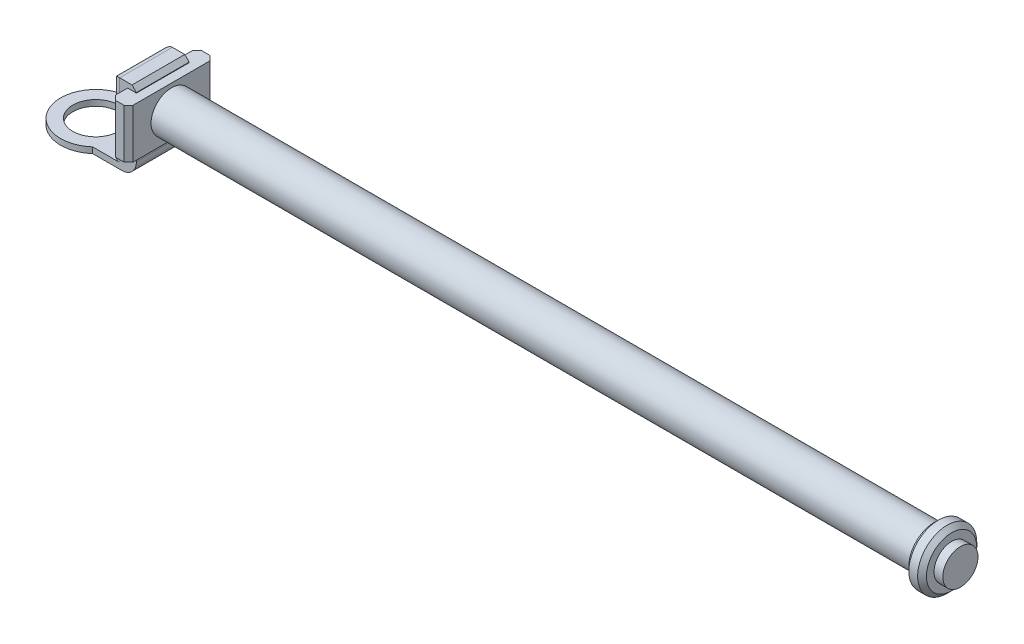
ISO-10303-21;
HEADER;
FILE_DESCRIPTION(('STEP AP214'),'2;1');
FILE_NAME('part.step','',(''),(''),'','','');
FILE_SCHEMA(('AUTOMOTIVE_DESIGN { 1 0 10303 214 1 1 1 1 }'));
ENDSEC;
DATA;
#1=APPLICATION_CONTEXT('core data for automotive mechanical design processes');
#2=APPLICATION_PROTOCOL_DEFINITION('international standard','automotive_design',2000,#1);
#3=PRODUCT_CONTEXT('',#1,'mechanical');
#4=PRODUCT('Part','Part','',(#3));
#5=PRODUCT_RELATED_PRODUCT_CATEGORY('part','',(#4));
#6=PRODUCT_DEFINITION_FORMATION('','',#4);
#7=PRODUCT_DEFINITION_CONTEXT('part definition',#1,'design');
#8=PRODUCT_DEFINITION('design','',#6,#7);
#9=PRODUCT_DEFINITION_SHAPE('','',#8);
#10=(LENGTH_UNIT() NAMED_UNIT(*) SI_UNIT(.MILLI.,.METRE.));
#11=(NAMED_UNIT(*) PLANE_ANGLE_UNIT() SI_UNIT($,.RADIAN.));
#12=(NAMED_UNIT(*) SI_UNIT($,.STERADIAN.) SOLID_ANGLE_UNIT());
#13=UNCERTAINTY_MEASURE_WITH_UNIT(LENGTH_MEASURE(1.E-05),#10,'distance_accuracy_value','');
#14=(GEOMETRIC_REPRESENTATION_CONTEXT(3) GLOBAL_UNCERTAINTY_ASSIGNED_CONTEXT((#13)) GLOBAL_UNIT_ASSIGNED_CONTEXT((#10,
#11,#12)) REPRESENTATION_CONTEXT('',''));
#15=CARTESIAN_POINT('',(0.,0.,0.));
#16=DIRECTION('',(0.,0.,1.));
#17=DIRECTION('',(1.,0.,0.));
#18=AXIS2_PLACEMENT_3D('',#15,#16,#17);
#19=CARTESIAN_POINT('',(0.,2.,-9.));
#20=DIRECTION('',(0.,0.,1.));
#21=DIRECTION('',(1.,0.,0.));
#22=AXIS2_PLACEMENT_3D('',#19,#20,#21);
#23=PLANE('',#22);
#24=DIRECTION('',(-1.,0.,0.));
#25=VECTOR('',#24,1.);
#26=CARTESIAN_POINT('',(0.,27.,-9.));
#27=LINE('',#26,#25);
#28=CARTESIAN_POINT('',(21.3554838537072,27.,-9.));
#29=VERTEX_POINT('',#28);
#30=CARTESIAN_POINT('',(17.1473964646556,27.,-9.));
#31=VERTEX_POINT('',#30);
#32=EDGE_CURVE('E196',#29,#31,#27,.T.);
#33=ORIENTED_EDGE('',*,*,#32,.F.);
#34=DIRECTION('',(0.707106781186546,-0.707106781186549,0.));
#35=VECTOR('',#34,1.);
#36=CARTESIAN_POINT('',(21.3554838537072,27.,-9.));
#37=LINE('',#36,#35);
#38=CARTESIAN_POINT('',(22.8554838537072,25.5,-9.));
#39=VERTEX_POINT('',#38);
#40=EDGE_CURVE('E231',#29,#39,#37,.T.);
#41=ORIENTED_EDGE('',*,*,#40,.T.);
#42=DIRECTION('',(0.,-1.,0.));
#43=VECTOR('',#42,1.);
#44=CARTESIAN_POINT('',(22.8554838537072,27.,-9.));
#45=LINE('',#44,#43);
#46=CARTESIAN_POINT('',(22.8554838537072,25.3259975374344,-9.));
#47=VERTEX_POINT('',#46);
#48=EDGE_CURVE('E195',#39,#47,#45,.T.);
#49=ORIENTED_EDGE('',*,*,#48,.T.);
#50=DIRECTION('',(1.,0.,0.));
#51=VECTOR('',#50,1.);
#52=CARTESIAN_POINT('',(0.,25.3259975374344,-9.));
#53=LINE('',#52,#51);
#54=CARTESIAN_POINT('',(19.8554838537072,25.3259975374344,-9.));
#55=VERTEX_POINT('',#54);
#56=EDGE_CURVE('E343',#55,#47,#53,.T.);
#57=ORIENTED_EDGE('',*,*,#56,.F.);
#58=DIRECTION('',(0.,-1.,0.));
#59=VECTOR('',#58,1.);
#60=CARTESIAN_POINT('',(19.8554838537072,2.,-9.));
#61=LINE('',#60,#59);
#62=CARTESIAN_POINT('',(19.8554838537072,8.51166149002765,-9.));
#63=VERTEX_POINT('',#62);
#64=EDGE_CURVE('E203',#55,#63,#61,.T.);
#65=ORIENTED_EDGE('',*,*,#64,.T.);
#66=DIRECTION('',(-1.,0.,0.));
#67=VECTOR('',#66,1.);
#68=CARTESIAN_POINT('',(0.,8.51166149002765,-9.));
#69=LINE('',#68,#67);
#70=CARTESIAN_POINT('',(22.8554838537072,8.51166149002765,-9.));
#71=VERTEX_POINT('',#70);
#72=EDGE_CURVE('E199',#71,#63,#69,.T.);
#73=ORIENTED_EDGE('',*,*,#72,.F.);
#74=CARTESIAN_POINT('',(22.8554838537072,5.,-9.));
#75=VERTEX_POINT('',#74);
#76=EDGE_CURVE('E185',#71,#75,#45,.T.);
#77=ORIENTED_EDGE('',*,*,#76,.T.);
#78=CARTESIAN_POINT('',(17.8554838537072,5.,-9.));
#79=DIRECTION('',(0.,0.,1.));
#80=DIRECTION('',(1.,0.,0.));
#81=AXIS2_PLACEMENT_3D('',#78,#79,#80);
#82=CIRCLE('',#81,5.);
#83=CARTESIAN_POINT('',(17.8554838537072,0.,-9.));
#84=VERTEX_POINT('',#83);
#85=EDGE_CURVE('E391',#75,#84,#82,.F.);
#86=ORIENTED_EDGE('',*,*,#85,.T.);
#87=DIRECTION('',(-1.,0.,0.));
#88=VECTOR('',#87,1.);
#89=CARTESIAN_POINT('',(0.,0.,-9.));
#90=LINE('',#89,#88);
#91=CARTESIAN_POINT('',(7.93725393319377,0.,-9.));
#92=VERTEX_POINT('',#91);
#93=EDGE_CURVE('E358',#84,#92,#90,.T.);
#94=ORIENTED_EDGE('',*,*,#93,.T.);
#95=DIRECTION('',(0.,-1.,0.));
#96=VECTOR('',#95,1.);
#97=CARTESIAN_POINT('',(7.93725393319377,2.,-9.));
#98=LINE('',#97,#96);
#99=CARTESIAN_POINT('',(7.93725393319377,2.,-9.));
#100=VERTEX_POINT('',#99);
#101=EDGE_CURVE('E368',#100,#92,#98,.T.);
#102=ORIENTED_EDGE('',*,*,#101,.F.);
#103=DIRECTION('',(-1.,0.,0.));
#104=VECTOR('',#103,1.);
#105=CARTESIAN_POINT('',(0.,2.,-9.));
#106=LINE('',#105,#104);
#107=CARTESIAN_POINT('',(17.1473964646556,2.,-9.));
#108=VERTEX_POINT('',#107);
#109=EDGE_CURVE('E359',#108,#100,#106,.T.);
#110=ORIENTED_EDGE('',*,*,#109,.F.);
#111=DIRECTION('',(0.,-1.,0.));
#112=VECTOR('',#111,1.);
#113=CARTESIAN_POINT('',(17.1473964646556,2.,-9.));
#114=LINE('',#113,#112);
#115=EDGE_CURVE('E405',#108,#31,#114,.F.);
#116=ORIENTED_EDGE('',*,*,#115,.T.);
#117=EDGE_LOOP('',(#33,#41,#49,#57,#65,#73,#77,#86,#94,#102,#110,#116));
#118=FACE_BOUND('',#117,.T.);
#119=ADVANCED_FACE('F35',(#118),#23,.F.);
#120=CARTESIAN_POINT('',(0.,2.,9.));
#121=DIRECTION('',(0.,0.,-1.));
#122=DIRECTION('',(-1.,0.,0.));
#123=AXIS2_PLACEMENT_3D('',#120,#121,#122);
#124=PLANE('',#123);
#125=DIRECTION('',(0.,-1.,0.));
#126=VECTOR('',#125,1.);
#127=CARTESIAN_POINT('',(22.8554838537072,27.,9.));
#128=LINE('',#127,#126);
#129=CARTESIAN_POINT('',(22.8554838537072,25.5,9.));
#130=VERTEX_POINT('',#129);
#131=CARTESIAN_POINT('',(22.8554838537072,25.3259975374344,9.));
#132=VERTEX_POINT('',#131);
#133=EDGE_CURVE('E356',#130,#132,#128,.T.);
#134=ORIENTED_EDGE('',*,*,#133,.F.);
#135=DIRECTION('',(-0.707106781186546,0.707106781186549,0.));
#136=VECTOR('',#135,1.);
#137=CARTESIAN_POINT('',(21.3554838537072,27.,9.));
#138=LINE('',#137,#136);
#139=CARTESIAN_POINT('',(21.3554838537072,27.,9.));
#140=VERTEX_POINT('',#139);
#141=EDGE_CURVE('E235',#130,#140,#138,.T.);
#142=ORIENTED_EDGE('',*,*,#141,.T.);
#143=DIRECTION('',(1.,0.,0.));
#144=VECTOR('',#143,1.);
#145=CARTESIAN_POINT('',(0.,27.,9.));
#146=LINE('',#145,#144);
#147=CARTESIAN_POINT('',(17.1473964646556,27.,9.));
#148=VERTEX_POINT('',#147);
#149=EDGE_CURVE('E348',#148,#140,#146,.T.);
#150=ORIENTED_EDGE('',*,*,#149,.F.);
#151=DIRECTION('',(0.,-1.,0.));
#152=VECTOR('',#151,1.);
#153=CARTESIAN_POINT('',(17.1473964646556,2.,9.));
#154=LINE('',#153,#152);
#155=CARTESIAN_POINT('',(17.1473964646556,2.,9.));
#156=VERTEX_POINT('',#155);
#157=EDGE_CURVE('E402',#148,#156,#154,.T.);
#158=ORIENTED_EDGE('',*,*,#157,.T.);
#159=DIRECTION('',(1.,0.,0.));
#160=VECTOR('',#159,1.);
#161=CARTESIAN_POINT('',(0.,2.,9.));
#162=LINE('',#161,#160);
#163=CARTESIAN_POINT('',(7.93725393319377,2.,9.));
#164=VERTEX_POINT('',#163);
#165=EDGE_CURVE('E361',#164,#156,#162,.T.);
#166=ORIENTED_EDGE('',*,*,#165,.F.);
#167=DIRECTION('',(0.,-1.,0.));
#168=VECTOR('',#167,1.);
#169=CARTESIAN_POINT('',(7.93725393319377,2.,9.));
#170=LINE('',#169,#168);
#171=CARTESIAN_POINT('',(7.93725393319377,0.,9.));
#172=VERTEX_POINT('',#171);
#173=EDGE_CURVE('E364',#164,#172,#170,.T.);
#174=ORIENTED_EDGE('',*,*,#173,.T.);
#175=DIRECTION('',(1.,0.,0.));
#176=VECTOR('',#175,1.);
#177=CARTESIAN_POINT('',(0.,0.,9.));
#178=LINE('',#177,#176);
#179=CARTESIAN_POINT('',(17.8554838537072,0.,9.));
#180=VERTEX_POINT('',#179);
#181=EDGE_CURVE('E362',#172,#180,#178,.T.);
#182=ORIENTED_EDGE('',*,*,#181,.T.);
#183=CARTESIAN_POINT('',(17.8554838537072,5.,9.));
#184=DIRECTION('',(0.,0.,-1.));
#185=DIRECTION('',(-1.,0.,0.));
#186=AXIS2_PLACEMENT_3D('',#183,#184,#185);
#187=CIRCLE('',#186,5.);
#188=CARTESIAN_POINT('',(22.8554838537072,5.,9.));
#189=VERTEX_POINT('',#188);
#190=EDGE_CURVE('E387',#180,#189,#187,.F.);
#191=ORIENTED_EDGE('',*,*,#190,.T.);
#192=CARTESIAN_POINT('',(22.8554838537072,8.51166149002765,9.));
#193=VERTEX_POINT('',#192);
#194=EDGE_CURVE('E355',#193,#189,#128,.T.);
#195=ORIENTED_EDGE('',*,*,#194,.F.);
#196=DIRECTION('',(1.,0.,0.));
#197=VECTOR('',#196,1.);
#198=CARTESIAN_POINT('',(0.,8.51166149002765,9.));
#199=LINE('',#198,#197);
#200=CARTESIAN_POINT('',(19.8554838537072,8.51166149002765,9.));
#201=VERTEX_POINT('',#200);
#202=EDGE_CURVE('E208',#201,#193,#199,.T.);
#203=ORIENTED_EDGE('',*,*,#202,.F.);
#204=DIRECTION('',(0.,1.,0.));
#205=VECTOR('',#204,1.);
#206=CARTESIAN_POINT('',(19.8554838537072,2.,9.));
#207=LINE('',#206,#205);
#208=CARTESIAN_POINT('',(19.8554838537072,25.3259975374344,9.));
#209=VERTEX_POINT('',#208);
#210=EDGE_CURVE('E218',#201,#209,#207,.T.);
#211=ORIENTED_EDGE('',*,*,#210,.T.);
#212=DIRECTION('',(-1.,0.,0.));
#213=VECTOR('',#212,1.);
#214=CARTESIAN_POINT('',(0.,25.3259975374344,9.));
#215=LINE('',#214,#213);
#216=EDGE_CURVE('E207',#132,#209,#215,.T.);
#217=ORIENTED_EDGE('',*,*,#216,.F.);
#218=EDGE_LOOP('',(#134,#142,#150,#158,#166,#174,#182,#191,#195,#203,#211,#217));
#219=FACE_BOUND('',#218,.T.);
#220=ADVANCED_FACE('F438',(#219),#124,.F.);
#221=CARTESIAN_POINT('',(22.8554838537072,27.,0.));
#222=DIRECTION('',(-1.,0.,0.));
#223=DIRECTION('',(0.,0.,1.));
#224=AXIS2_PLACEMENT_3D('',#221,#222,#223);
#225=PLANE('',#224);
#226=ORIENTED_EDGE('',*,*,#48,.F.);
#227=DIRECTION('',(0.,0.,1.));
#228=VECTOR('',#227,1.);
#229=CARTESIAN_POINT('',(22.8554838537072,25.5,9.));
#230=LINE('',#229,#228);
#231=EDGE_CURVE('E233',#39,#130,#230,.T.);
#232=ORIENTED_EDGE('',*,*,#231,.T.);
#233=ORIENTED_EDGE('',*,*,#133,.T.);
#234=DIRECTION('',(0.,0.,1.));
#235=VECTOR('',#234,1.);
#236=CARTESIAN_POINT('',(22.8554838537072,25.3259975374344,0.));
#237=LINE('',#236,#235);
#238=EDGE_CURVE('E214',#47,#132,#237,.T.);
#239=ORIENTED_EDGE('',*,*,#238,.F.);
#240=EDGE_LOOP('',(#226,#232,#233,#239));
#241=FACE_BOUND('',#240,.T.);
#242=ADVANCED_FACE('F509',(#241),#225,.F.);
#243=DIRECTION('',(0.,0.,-1.));
#244=VECTOR('',#243,1.);
#245=CARTESIAN_POINT('',(22.8554838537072,8.51166149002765,0.));
#246=LINE('',#245,#244);
#247=EDGE_CURVE('E189',#193,#71,#246,.T.);
#248=ORIENTED_EDGE('',*,*,#247,.F.);
#249=ORIENTED_EDGE('',*,*,#194,.T.);
#250=DIRECTION('',(0.,0.,1.));
#251=VECTOR('',#250,1.);
#252=CARTESIAN_POINT('',(22.8554838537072,5.,0.));
#253=LINE('',#252,#251);
#254=EDGE_CURVE('E192',#189,#75,#253,.F.);
#255=ORIENTED_EDGE('',*,*,#254,.T.);
#256=ORIENTED_EDGE('',*,*,#76,.F.);
#257=EDGE_LOOP('',(#248,#249,#255,#256));
#258=FACE_BOUND('',#257,.T.);
#259=ADVANCED_FACE('F187',(#258),#225,.F.);
#260=CARTESIAN_POINT('',(0.,2.,0.));
#261=DIRECTION('',(0.,1.,0.));
#262=DIRECTION('',(0.,0.,1.));
#263=AXIS2_PLACEMENT_3D('',#260,#261,#262);
#264=PLANE('',#263);
#265=DIRECTION('',(0.,0.,1.));
#266=VECTOR('',#265,1.);
#267=CARTESIAN_POINT('',(14.6473964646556,2.,0.));
#268=LINE('',#267,#266);
#269=CARTESIAN_POINT('',(14.6473964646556,2.,-6.5));
#270=VERTEX_POINT('',#269);
#271=CARTESIAN_POINT('',(14.6473964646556,2.,6.5));
#272=VERTEX_POINT('',#271);
#273=EDGE_CURVE('E351',#270,#272,#268,.T.);
#274=ORIENTED_EDGE('',*,*,#273,.F.);
#275=CARTESIAN_POINT('',(17.1473964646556,1.99999999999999,-6.5));
#276=DIRECTION('',(0.,1.,0.));
#277=DIRECTION('',(0.,0.,1.));
#278=AXIS2_PLACEMENT_3D('',#275,#276,#277);
#279=CIRCLE('',#278,2.5);
#280=EDGE_CURVE('E215',#270,#108,#279,.F.);
#281=ORIENTED_EDGE('',*,*,#280,.T.);
#282=ORIENTED_EDGE('',*,*,#109,.T.);
#283=CARTESIAN_POINT('',(0.,2.,0.));
#284=DIRECTION('',(0.,1.,0.));
#285=DIRECTION('',(0.,0.,1.));
#286=AXIS2_PLACEMENT_3D('',#283,#284,#285);
#287=CIRCLE('',#286,12.);
#288=EDGE_CURVE('E377',#100,#164,#287,.T.);
#289=ORIENTED_EDGE('',*,*,#288,.T.);
#290=ORIENTED_EDGE('',*,*,#165,.T.);
#291=CARTESIAN_POINT('',(17.1473964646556,2.,6.5));
#292=DIRECTION('',(0.,1.,0.));
#293=DIRECTION('',(0.,0.,1.));
#294=AXIS2_PLACEMENT_3D('',#291,#292,#293);
#295=CIRCLE('',#294,2.5);
#296=EDGE_CURVE('E221',#156,#272,#295,.F.);
#297=ORIENTED_EDGE('',*,*,#296,.T.);
#298=EDGE_LOOP('',(#274,#281,#282,#289,#290,#297));
#299=FACE_BOUND('',#298,.T.);
#300=CARTESIAN_POINT('',(0.,2.,0.));
#301=DIRECTION('',(0.,1.,0.));
#302=DIRECTION('',(0.,0.,1.));
#303=AXIS2_PLACEMENT_3D('',#300,#301,#302);
#304=CIRCLE('',#303,7.8);
#305=CARTESIAN_POINT('',(0.,2.,7.8));
#306=VERTEX_POINT('',#305);
#307=EDGE_CURVE('E374',#306,#306,#304,.T.);
#308=ORIENTED_EDGE('',*,*,#307,.F.);
#309=EDGE_LOOP('',(#308));
#310=FACE_BOUND('',#309,.T.);
#311=ADVANCED_FACE('F426',(#299,#310),#264,.T.);
#312=CARTESIAN_POINT('',(0.,2.,0.));
#313=DIRECTION('',(0.,-1.,0.));
#314=DIRECTION('',(0.,0.,-1.));
#315=AXIS2_PLACEMENT_3D('',#312,#313,#314);
#316=CYLINDRICAL_SURFACE('',#315,12.);
#317=ORIENTED_EDGE('',*,*,#101,.T.);
#318=CARTESIAN_POINT('',(0.,0.,0.));
#319=DIRECTION('',(0.,1.,0.));
#320=DIRECTION('',(0.,0.,1.));
#321=AXIS2_PLACEMENT_3D('',#318,#319,#320);
#322=CIRCLE('',#321,12.);
#323=EDGE_CURVE('E378',#92,#172,#322,.T.);
#324=ORIENTED_EDGE('',*,*,#323,.T.);
#325=ORIENTED_EDGE('',*,*,#173,.F.);
#326=ORIENTED_EDGE('',*,*,#288,.F.);
#327=EDGE_LOOP('',(#317,#324,#325,#326));
#328=FACE_BOUND('',#327,.T.);
#329=ADVANCED_FACE('F448',(#328),#316,.T.);
#330=CARTESIAN_POINT('',(0.,2.,0.));
#331=DIRECTION('',(0.,-1.,0.));
#332=DIRECTION('',(0.,0.,-1.));
#333=AXIS2_PLACEMENT_3D('',#330,#331,#332);
#334=CYLINDRICAL_SURFACE('',#333,7.8);
#335=ORIENTED_EDGE('',*,*,#307,.T.);
#336=EDGE_LOOP('',(#335));
#337=FACE_BOUND('',#336,.T.);
#338=CARTESIAN_POINT('',(0.,0.,0.));
#339=DIRECTION('',(0.,1.,0.));
#340=DIRECTION('',(0.,0.,1.));
#341=AXIS2_PLACEMENT_3D('',#338,#339,#340);
#342=CIRCLE('',#341,7.8);
#343=CARTESIAN_POINT('',(0.,0.,7.8));
#344=VERTEX_POINT('',#343);
#345=EDGE_CURVE('E371',#344,#344,#342,.T.);
#346=ORIENTED_EDGE('',*,*,#345,.F.);
#347=EDGE_LOOP('',(#346));
#348=FACE_BOUND('',#347,.T.);
#349=ADVANCED_FACE('F517',(#337,#348),#334,.F.);
#350=CARTESIAN_POINT('',(0.,0.,0.));
#351=DIRECTION('',(0.,1.,0.));
#352=DIRECTION('',(0.,0.,1.));
#353=AXIS2_PLACEMENT_3D('',#350,#351,#352);
#354=PLANE('',#353);
#355=ORIENTED_EDGE('',*,*,#345,.T.);
#356=EDGE_LOOP('',(#355));
#357=FACE_BOUND('',#356,.T.);
#358=ORIENTED_EDGE('',*,*,#93,.F.);
#359=DIRECTION('',(0.,0.,1.));
#360=VECTOR('',#359,1.);
#361=CARTESIAN_POINT('',(17.8554838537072,0.,0.));
#362=LINE('',#361,#360);
#363=EDGE_CURVE('E381',#84,#180,#362,.T.);
#364=ORIENTED_EDGE('',*,*,#363,.T.);
#365=ORIENTED_EDGE('',*,*,#181,.F.);
#366=ORIENTED_EDGE('',*,*,#323,.F.);
#367=EDGE_LOOP('',(#358,#364,#365,#366));
#368=FACE_BOUND('',#367,.T.);
#369=ADVANCED_FACE('F453',(#357,#368),#354,.F.);
#370=CARTESIAN_POINT('',(14.6473964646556,27.,0.));
#371=DIRECTION('',(1.,0.,0.));
#372=DIRECTION('',(0.,0.,-1.));
#373=AXIS2_PLACEMENT_3D('',#370,#371,#372);
#374=PLANE('',#373);
#375=ORIENTED_EDGE('',*,*,#273,.T.);
#376=DIRECTION('',(0.,-1.,0.));
#377=VECTOR('',#376,1.);
#378=CARTESIAN_POINT('',(14.6473964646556,27.,6.5));
#379=LINE('',#378,#377);
#380=CARTESIAN_POINT('',(14.6473964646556,24.5,6.5));
#381=VERTEX_POINT('',#380);
#382=EDGE_CURVE('E400',#272,#381,#379,.F.);
#383=ORIENTED_EDGE('',*,*,#382,.T.);
#384=DIRECTION('',(0.,0.,1.));
#385=VECTOR('',#384,1.);
#386=CARTESIAN_POINT('',(14.6473964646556,24.5,-9.));
#387=LINE('',#386,#385);
#388=CARTESIAN_POINT('',(14.6473964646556,24.5,-6.5));
#389=VERTEX_POINT('',#388);
#390=EDGE_CURVE('E398',#381,#389,#387,.F.);
#391=ORIENTED_EDGE('',*,*,#390,.T.);
#392=DIRECTION('',(0.,-1.,0.));
#393=VECTOR('',#392,1.);
#394=CARTESIAN_POINT('',(14.6473964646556,27.,-6.5));
#395=LINE('',#394,#393);
#396=EDGE_CURVE('E396',#389,#270,#395,.T.);
#397=ORIENTED_EDGE('',*,*,#396,.T.);
#398=EDGE_LOOP('',(#375,#383,#391,#397));
#399=FACE_BOUND('',#398,.T.);
#400=ADVANCED_FACE('F423',(#399),#374,.F.);
#401=CARTESIAN_POINT('',(0.,27.,0.));
#402=DIRECTION('',(0.,1.,0.));
#403=DIRECTION('',(0.,0.,1.));
#404=AXIS2_PLACEMENT_3D('',#401,#402,#403);
#405=PLANE('',#404);
#406=ORIENTED_EDGE('',*,*,#149,.T.);
#407=DIRECTION('',(0.,0.,-1.));
#408=VECTOR('',#407,1.);
#409=CARTESIAN_POINT('',(21.3554838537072,27.,-9.));
#410=LINE('',#409,#408);
#411=EDGE_CURVE('E228',#140,#29,#410,.T.);
#412=ORIENTED_EDGE('',*,*,#411,.T.);
#413=ORIENTED_EDGE('',*,*,#32,.T.);
#414=DIRECTION('',(0.,0.,1.));
#415=VECTOR('',#414,1.);
#416=CARTESIAN_POINT('',(17.1473964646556,27.,9.));
#417=LINE('',#416,#415);
#418=EDGE_CURVE('E393',#31,#148,#417,.T.);
#419=ORIENTED_EDGE('',*,*,#418,.T.);
#420=EDGE_LOOP('',(#406,#412,#413,#419));
#421=FACE_BOUND('',#420,.T.);
#422=ADVANCED_FACE('F435',(#421),#405,.T.);
#423=CARTESIAN_POINT('',(17.8554838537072,5.,0.));
#424=DIRECTION('',(0.,0.,1.));
#425=DIRECTION('',(1.,0.,0.));
#426=AXIS2_PLACEMENT_3D('',#423,#424,#425);
#427=CYLINDRICAL_SURFACE('',#426,5.);
#428=ORIENTED_EDGE('',*,*,#85,.F.);
#429=ORIENTED_EDGE('',*,*,#254,.F.);
#430=ORIENTED_EDGE('',*,*,#190,.F.);
#431=ORIENTED_EDGE('',*,*,#363,.F.);
#432=EDGE_LOOP('',(#428,#429,#430,#431));
#433=FACE_BOUND('',#432,.T.);
#434=ADVANCED_FACE('F456',(#433),#427,.T.);
#435=CARTESIAN_POINT('',(17.1473964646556,27.,-6.5));
#436=DIRECTION('',(0.,-1.,0.));
#437=DIRECTION('',(0.,0.,-1.));
#438=AXIS2_PLACEMENT_3D('',#435,#436,#437);
#439=CYLINDRICAL_SURFACE('',#438,2.5);
#440=ORIENTED_EDGE('',*,*,#280,.F.);
#441=ORIENTED_EDGE('',*,*,#396,.F.);
#442=CARTESIAN_POINT('',(17.1473964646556,24.5,-6.5));
#443=DIRECTION('',(0.,-0.707106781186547,-0.707106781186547));
#444=DIRECTION('',(0.,-0.707106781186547,0.707106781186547));
#445=AXIS2_PLACEMENT_3D('',#442,#443,#444);
#446=ELLIPSE('',#445,3.53553390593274,2.5);
#447=EDGE_CURVE('E224',#31,#389,#446,.F.);
#448=ORIENTED_EDGE('',*,*,#447,.F.);
#449=ORIENTED_EDGE('',*,*,#115,.F.);
#450=EDGE_LOOP('',(#440,#441,#448,#449));
#451=FACE_BOUND('',#450,.T.);
#452=ADVANCED_FACE('F420',(#451),#439,.T.);
#453=CARTESIAN_POINT('',(17.1473964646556,2.,6.5));
#454=DIRECTION('',(0.,-1.,0.));
#455=DIRECTION('',(0.,0.,-1.));
#456=AXIS2_PLACEMENT_3D('',#453,#454,#455);
#457=CYLINDRICAL_SURFACE('',#456,2.5);
#458=ORIENTED_EDGE('',*,*,#296,.F.);
#459=ORIENTED_EDGE('',*,*,#157,.F.);
#460=CARTESIAN_POINT('',(17.1473964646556,24.5,6.5));
#461=DIRECTION('',(0.,-0.707106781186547,0.707106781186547));
#462=DIRECTION('',(0.,-0.707106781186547,-0.707106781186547));
#463=AXIS2_PLACEMENT_3D('',#460,#461,#462);
#464=ELLIPSE('',#463,3.53553390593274,2.5);
#465=EDGE_CURVE('E347',#381,#148,#464,.F.);
#466=ORIENTED_EDGE('',*,*,#465,.F.);
#467=ORIENTED_EDGE('',*,*,#382,.F.);
#468=EDGE_LOOP('',(#458,#459,#466,#467));
#469=FACE_BOUND('',#468,.T.);
#470=ADVANCED_FACE('F431',(#469),#457,.T.);
#471=CARTESIAN_POINT('',(17.1473964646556,24.5,0.));
#472=DIRECTION('',(0.,0.,-1.));
#473=DIRECTION('',(-1.,0.,0.));
#474=AXIS2_PLACEMENT_3D('',#471,#472,#473);
#475=CYLINDRICAL_SURFACE('',#474,2.5);
#476=ORIENTED_EDGE('',*,*,#447,.T.);
#477=ORIENTED_EDGE('',*,*,#390,.F.);
#478=ORIENTED_EDGE('',*,*,#465,.T.);
#479=ORIENTED_EDGE('',*,*,#418,.F.);
#480=EDGE_LOOP('',(#476,#477,#478,#479));
#481=FACE_BOUND('',#480,.T.);
#482=ADVANCED_FACE('F415',(#481),#475,.T.);
#483=CARTESIAN_POINT('',(19.8554838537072,0.,0.));
#484=DIRECTION('',(-1.,0.,0.));
#485=DIRECTION('',(0.,0.,1.));
#486=AXIS2_PLACEMENT_3D('',#483,#484,#485);
#487=PLANE('',#486);
#488=DIRECTION('',(0.,0.,1.));
#489=VECTOR('',#488,1.);
#490=CARTESIAN_POINT('',(19.8554838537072,25.3259975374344,14.6883855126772));
#491=LINE('',#490,#489);
#492=CARTESIAN_POINT('',(19.8554838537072,25.3259975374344,-13.1883855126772));
#493=VERTEX_POINT('',#492);
#494=EDGE_CURVE('E318',#493,#55,#491,.T.);
#495=ORIENTED_EDGE('',*,*,#494,.F.);
#496=DIRECTION('',(0.,-1.,0.));
#497=VECTOR('',#496,1.);
#498=CARTESIAN_POINT('',(19.8554838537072,8.51166149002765,-13.1883855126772));
#499=LINE('',#498,#497);
#500=CARTESIAN_POINT('',(19.8554838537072,8.51166149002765,-13.1883855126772));
#501=VERTEX_POINT('',#500);
#502=EDGE_CURVE('E266',#493,#501,#499,.T.);
#503=ORIENTED_EDGE('',*,*,#502,.T.);
#504=DIRECTION('',(0.,0.,-1.));
#505=VECTOR('',#504,1.);
#506=CARTESIAN_POINT('',(19.8554838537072,8.51166149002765,14.6883855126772));
#507=LINE('',#506,#505);
#508=EDGE_CURVE('E320',#63,#501,#507,.T.);
#509=ORIENTED_EDGE('',*,*,#508,.F.);
#510=ORIENTED_EDGE('',*,*,#64,.F.);
#511=EDGE_LOOP('',(#495,#503,#509,#510));
#512=FACE_BOUND('',#511,.T.);
#513=ADVANCED_FACE('F492',(#512),#487,.T.);
#514=CARTESIAN_POINT('',(19.8554838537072,8.51166149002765,13.1883855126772));
#515=VERTEX_POINT('',#514);
#516=EDGE_CURVE('E321',#515,#201,#507,.T.);
#517=ORIENTED_EDGE('',*,*,#516,.F.);
#518=DIRECTION('',(0.,1.,0.));
#519=VECTOR('',#518,1.);
#520=CARTESIAN_POINT('',(19.8554838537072,25.3259975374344,13.1883855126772));
#521=LINE('',#520,#519);
#522=CARTESIAN_POINT('',(19.8554838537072,25.3259975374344,13.1883855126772));
#523=VERTEX_POINT('',#522);
#524=EDGE_CURVE('E268',#515,#523,#521,.T.);
#525=ORIENTED_EDGE('',*,*,#524,.T.);
#526=EDGE_CURVE('E317',#209,#523,#491,.T.);
#527=ORIENTED_EDGE('',*,*,#526,.F.);
#528=ORIENTED_EDGE('',*,*,#210,.F.);
#529=EDGE_LOOP('',(#517,#525,#527,#528));
#530=FACE_BOUND('',#529,.T.);
#531=ADVANCED_FACE('F461',(#530),#487,.T.);
#532=CARTESIAN_POINT('',(25.8554838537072,25.3259975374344,14.6883855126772));
#533=DIRECTION('',(0.,-1.,0.));
#534=DIRECTION('',(0.,0.,-1.));
#535=AXIS2_PLACEMENT_3D('',#532,#533,#534);
#536=PLANE('',#535);
#537=DIRECTION('',(-1.,0.,0.));
#538=VECTOR('',#537,1.);
#539=CARTESIAN_POINT('',(25.8554838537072,25.3259975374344,14.6883855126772));
#540=LINE('',#539,#538);
#541=CARTESIAN_POINT('',(24.3554838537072,25.3259975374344,14.6883855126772));
#542=VERTEX_POINT('',#541);
#543=CARTESIAN_POINT('',(21.3554838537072,25.3259975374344,14.6883855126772));
#544=VERTEX_POINT('',#543);
#545=EDGE_CURVE('E335',#542,#544,#540,.T.);
#546=ORIENTED_EDGE('',*,*,#545,.F.);
#547=DIRECTION('',(-0.707106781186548,0.,0.707106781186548));
#548=VECTOR('',#547,1.);
#549=CARTESIAN_POINT('',(25.8554838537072,25.3259975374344,13.1883855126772));
#550=LINE('',#549,#548);
#551=CARTESIAN_POINT('',(25.8554838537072,25.3259975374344,13.1883855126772));
#552=VERTEX_POINT('',#551);
#553=EDGE_CURVE('E260',#542,#552,#550,.F.);
#554=ORIENTED_EDGE('',*,*,#553,.T.);
#555=DIRECTION('',(0.,0.,1.));
#556=VECTOR('',#555,1.);
#557=CARTESIAN_POINT('',(25.8554838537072,25.3259975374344,14.6883855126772));
#558=LINE('',#557,#556);
#559=CARTESIAN_POINT('',(25.8554838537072,25.3259975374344,-13.1883855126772));
#560=VERTEX_POINT('',#559);
#561=EDGE_CURVE('E323',#560,#552,#558,.T.);
#562=ORIENTED_EDGE('',*,*,#561,.F.);
#563=DIRECTION('',(0.707106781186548,0.,0.707106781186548));
#564=VECTOR('',#563,1.);
#565=CARTESIAN_POINT('',(25.8554838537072,25.3259975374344,-13.1883855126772));
#566=LINE('',#565,#564);
#567=CARTESIAN_POINT('',(24.3554838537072,25.3259975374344,-14.6883855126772));
#568=VERTEX_POINT('',#567);
#569=EDGE_CURVE('E58',#560,#568,#566,.F.);
#570=ORIENTED_EDGE('',*,*,#569,.T.);
#571=DIRECTION('',(-1.,0.,0.));
#572=VECTOR('',#571,1.);
#573=CARTESIAN_POINT('',(25.8554838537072,25.3259975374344,-14.6883855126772));
#574=LINE('',#573,#572);
#575=CARTESIAN_POINT('',(21.3554838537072,25.3259975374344,-14.6883855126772));
#576=VERTEX_POINT('',#575);
#577=EDGE_CURVE('E338',#568,#576,#574,.T.);
#578=ORIENTED_EDGE('',*,*,#577,.T.);
#579=DIRECTION('',(-0.707106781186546,0.,0.707106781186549));
#580=VECTOR('',#579,1.);
#581=CARTESIAN_POINT('',(21.3554838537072,25.3259975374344,-14.6883855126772));
#582=LINE('',#581,#580);
#583=EDGE_CURVE('E50',#576,#493,#582,.T.);
#584=ORIENTED_EDGE('',*,*,#583,.T.);
#585=ORIENTED_EDGE('',*,*,#494,.T.);
#586=ORIENTED_EDGE('',*,*,#56,.T.);
#587=ORIENTED_EDGE('',*,*,#238,.T.);
#588=ORIENTED_EDGE('',*,*,#216,.T.);
#589=ORIENTED_EDGE('',*,*,#526,.T.);
#590=DIRECTION('',(0.707106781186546,0.,0.707106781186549));
#591=VECTOR('',#590,1.);
#592=CARTESIAN_POINT('',(21.3554838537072,25.3259975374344,14.6883855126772));
#593=LINE('',#592,#591);
#594=EDGE_CURVE('E256',#523,#544,#593,.T.);
#595=ORIENTED_EDGE('',*,*,#594,.T.);
#596=EDGE_LOOP('',(#546,#554,#562,#570,#578,#584,#585,#586,#587,#588,#589,#595));
#597=FACE_BOUND('',#596,.T.);
#598=ADVANCED_FACE('F466',(#597),#536,.F.);
#599=CARTESIAN_POINT('',(25.8554838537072,8.51166149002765,14.6883855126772));
#600=DIRECTION('',(0.,1.,0.));
#601=DIRECTION('',(0.,0.,1.));
#602=AXIS2_PLACEMENT_3D('',#599,#600,#601);
#603=PLANE('',#602);
#604=DIRECTION('',(0.,0.,-1.));
#605=VECTOR('',#604,1.);
#606=CARTESIAN_POINT('',(25.8554838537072,8.51166149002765,14.6883855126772));
#607=LINE('',#606,#605);
#608=CARTESIAN_POINT('',(25.8554838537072,8.51166149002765,13.1883855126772));
#609=VERTEX_POINT('',#608);
#610=CARTESIAN_POINT('',(25.8554838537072,8.51166149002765,-13.1883855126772));
#611=VERTEX_POINT('',#610);
#612=EDGE_CURVE('E326',#609,#611,#607,.T.);
#613=ORIENTED_EDGE('',*,*,#612,.F.);
#614=DIRECTION('',(0.707106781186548,0.,-0.707106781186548));
#615=VECTOR('',#614,1.);
#616=CARTESIAN_POINT('',(25.8554838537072,8.51166149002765,13.1883855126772));
#617=LINE('',#616,#615);
#618=CARTESIAN_POINT('',(24.3554838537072,8.51166149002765,14.6883855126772));
#619=VERTEX_POINT('',#618);
#620=EDGE_CURVE('E249',#609,#619,#617,.F.);
#621=ORIENTED_EDGE('',*,*,#620,.T.);
#622=DIRECTION('',(-1.,0.,0.));
#623=VECTOR('',#622,1.);
#624=CARTESIAN_POINT('',(25.8554838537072,8.51166149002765,14.6883855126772));
#625=LINE('',#624,#623);
#626=CARTESIAN_POINT('',(21.3554838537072,8.51166149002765,14.6883855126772));
#627=VERTEX_POINT('',#626);
#628=EDGE_CURVE('E332',#619,#627,#625,.T.);
#629=ORIENTED_EDGE('',*,*,#628,.T.);
#630=DIRECTION('',(-0.707106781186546,0.,-0.707106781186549));
#631=VECTOR('',#630,1.);
#632=CARTESIAN_POINT('',(21.3554838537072,8.51166149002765,14.6883855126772));
#633=LINE('',#632,#631);
#634=EDGE_CURVE('E243',#627,#515,#633,.T.);
#635=ORIENTED_EDGE('',*,*,#634,.T.);
#636=ORIENTED_EDGE('',*,*,#516,.T.);
#637=ORIENTED_EDGE('',*,*,#202,.T.);
#638=ORIENTED_EDGE('',*,*,#247,.T.);
#639=ORIENTED_EDGE('',*,*,#72,.T.);
#640=ORIENTED_EDGE('',*,*,#508,.T.);
#641=DIRECTION('',(0.707106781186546,0.,-0.707106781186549));
#642=VECTOR('',#641,1.);
#643=CARTESIAN_POINT('',(21.3554838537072,8.51166149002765,-14.6883855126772));
#644=LINE('',#643,#642);
#645=CARTESIAN_POINT('',(21.3554838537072,8.51166149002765,-14.6883855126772));
#646=VERTEX_POINT('',#645);
#647=EDGE_CURVE('E245',#501,#646,#644,.T.);
#648=ORIENTED_EDGE('',*,*,#647,.T.);
#649=DIRECTION('',(-1.,0.,0.));
#650=VECTOR('',#649,1.);
#651=CARTESIAN_POINT('',(25.8554838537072,8.51166149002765,-14.6883855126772));
#652=LINE('',#651,#650);
#653=CARTESIAN_POINT('',(24.3554838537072,8.51166149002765,-14.6883855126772));
#654=VERTEX_POINT('',#653);
#655=EDGE_CURVE('E329',#654,#646,#652,.T.);
#656=ORIENTED_EDGE('',*,*,#655,.F.);
#657=DIRECTION('',(-0.707106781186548,0.,-0.707106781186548));
#658=VECTOR('',#657,1.);
#659=CARTESIAN_POINT('',(25.8554838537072,8.51166149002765,-13.1883855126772));
#660=LINE('',#659,#658);
#661=EDGE_CURVE('E247',#654,#611,#660,.F.);
#662=ORIENTED_EDGE('',*,*,#661,.T.);
#663=EDGE_LOOP('',(#613,#621,#629,#635,#636,#637,#638,#639,#640,#648,#656,#662));
#664=FACE_BOUND('',#663,.T.);
#665=ADVANCED_FACE('F212',(#664),#603,.F.);
#666=CARTESIAN_POINT('',(25.8554838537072,8.51166149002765,-14.6883855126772));
#667=DIRECTION('',(0.,0.,1.));
#668=DIRECTION('',(1.,0.,0.));
#669=AXIS2_PLACEMENT_3D('',#666,#667,#668);
#670=PLANE('',#669);
#671=ORIENTED_EDGE('',*,*,#577,.F.);
#672=DIRECTION('',(0.,-1.,0.));
#673=VECTOR('',#672,1.);
#674=CARTESIAN_POINT('',(24.3554838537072,8.51166149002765,-14.6883855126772));
#675=LINE('',#674,#673);
#676=EDGE_CURVE('E264',#568,#654,#675,.T.);
#677=ORIENTED_EDGE('',*,*,#676,.T.);
#678=ORIENTED_EDGE('',*,*,#655,.T.);
#679=DIRECTION('',(0.,1.,0.));
#680=VECTOR('',#679,1.);
#681=CARTESIAN_POINT('',(21.3554838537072,25.3259975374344,-14.6883855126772));
#682=LINE('',#681,#680);
#683=EDGE_CURVE('E262',#646,#576,#682,.T.);
#684=ORIENTED_EDGE('',*,*,#683,.T.);
#685=EDGE_LOOP('',(#671,#677,#678,#684));
#686=FACE_BOUND('',#685,.T.);
#687=ADVANCED_FACE('F487',(#686),#670,.F.);
#688=CARTESIAN_POINT('',(25.8554838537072,8.51166149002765,14.6883855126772));
#689=DIRECTION('',(0.,0.,-1.));
#690=DIRECTION('',(-1.,0.,0.));
#691=AXIS2_PLACEMENT_3D('',#688,#689,#690);
#692=PLANE('',#691);
#693=ORIENTED_EDGE('',*,*,#628,.F.);
#694=DIRECTION('',(0.,1.,0.));
#695=VECTOR('',#694,1.);
#696=CARTESIAN_POINT('',(24.3554838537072,8.51166149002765,14.6883855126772));
#697=LINE('',#696,#695);
#698=EDGE_CURVE('E254',#619,#542,#697,.T.);
#699=ORIENTED_EDGE('',*,*,#698,.T.);
#700=ORIENTED_EDGE('',*,*,#545,.T.);
#701=DIRECTION('',(0.,-1.,0.));
#702=VECTOR('',#701,1.);
#703=CARTESIAN_POINT('',(21.3554838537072,8.51166149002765,14.6883855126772));
#704=LINE('',#703,#702);
#705=EDGE_CURVE('E251',#544,#627,#704,.T.);
#706=ORIENTED_EDGE('',*,*,#705,.T.);
#707=EDGE_LOOP('',(#693,#699,#700,#706));
#708=FACE_BOUND('',#707,.T.);
#709=ADVANCED_FACE('F472',(#708),#692,.F.);
#710=CARTESIAN_POINT('',(25.8554838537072,0.,0.));
#711=DIRECTION('',(-1.,0.,0.));
#712=DIRECTION('',(0.,0.,1.));
#713=AXIS2_PLACEMENT_3D('',#710,#711,#712);
#714=PLANE('',#713);
#715=CARTESIAN_POINT('',(25.8554838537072,16.918829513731,0.));
#716=DIRECTION('',(-1.,0.,0.));
#717=DIRECTION('',(0.,0.,1.));
#718=AXIS2_PLACEMENT_3D('',#715,#716,#717);
#719=CIRCLE('',#718,7.);
#720=CARTESIAN_POINT('',(25.8554838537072,16.918829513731,7.));
#721=VERTEX_POINT('',#720);
#722=EDGE_CURVE('E270',#721,#721,#719,.F.);
#723=ORIENTED_EDGE('',*,*,#722,.F.);
#724=EDGE_LOOP('',(#723));
#725=FACE_BOUND('',#724,.T.);
#726=ORIENTED_EDGE('',*,*,#561,.T.);
#727=DIRECTION('',(0.,-1.,0.));
#728=VECTOR('',#727,1.);
#729=CARTESIAN_POINT('',(25.8554838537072,0.,13.1883855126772));
#730=LINE('',#729,#728);
#731=EDGE_CURVE('E240',#552,#609,#730,.T.);
#732=ORIENTED_EDGE('',*,*,#731,.T.);
#733=ORIENTED_EDGE('',*,*,#612,.T.);
#734=DIRECTION('',(0.,1.,0.));
#735=VECTOR('',#734,1.);
#736=CARTESIAN_POINT('',(25.8554838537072,0.,-13.1883855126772));
#737=LINE('',#736,#735);
#738=EDGE_CURVE('E237',#611,#560,#737,.T.);
#739=ORIENTED_EDGE('',*,*,#738,.T.);
#740=EDGE_LOOP('',(#726,#732,#733,#739));
#741=FACE_BOUND('',#740,.T.);
#742=ADVANCED_FACE('F479',(#725,#741),#714,.F.);
#743=CARTESIAN_POINT('',(21.3554838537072,27.,0.));
#744=DIRECTION('',(0.707106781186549,0.707106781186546,0.));
#745=DIRECTION('',(0.,0.,1.));
#746=AXIS2_PLACEMENT_3D('',#743,#744,#745);
#747=PLANE('',#746);
#748=ORIENTED_EDGE('',*,*,#141,.F.);
#749=ORIENTED_EDGE('',*,*,#231,.F.);
#750=ORIENTED_EDGE('',*,*,#40,.F.);
#751=ORIENTED_EDGE('',*,*,#411,.F.);
#752=EDGE_LOOP('',(#748,#749,#750,#751));
#753=FACE_BOUND('',#752,.T.);
#754=ADVANCED_FACE('F443',(#753),#747,.T.);
#755=CARTESIAN_POINT('',(25.8554838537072,0.,13.1883855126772));
#756=DIRECTION('',(-0.707106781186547,0.,-0.707106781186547));
#757=DIRECTION('',(0.,-1.,0.));
#758=AXIS2_PLACEMENT_3D('',#755,#756,#757);
#759=PLANE('',#758);
#760=ORIENTED_EDGE('',*,*,#553,.F.);
#761=ORIENTED_EDGE('',*,*,#698,.F.);
#762=ORIENTED_EDGE('',*,*,#620,.F.);
#763=ORIENTED_EDGE('',*,*,#731,.F.);
#764=EDGE_LOOP('',(#760,#761,#762,#763));
#765=FACE_BOUND('',#764,.T.);
#766=ADVANCED_FACE('F477',(#765),#759,.F.);
#767=CARTESIAN_POINT('',(25.8554838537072,0.,-13.1883855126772));
#768=DIRECTION('',(-0.707106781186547,0.,0.707106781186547));
#769=DIRECTION('',(0.,1.,0.));
#770=AXIS2_PLACEMENT_3D('',#767,#768,#769);
#771=PLANE('',#770);
#772=ORIENTED_EDGE('',*,*,#661,.F.);
#773=ORIENTED_EDGE('',*,*,#676,.F.);
#774=ORIENTED_EDGE('',*,*,#569,.F.);
#775=ORIENTED_EDGE('',*,*,#738,.F.);
#776=EDGE_LOOP('',(#772,#773,#774,#775));
#777=FACE_BOUND('',#776,.T.);
#778=ADVANCED_FACE('F483',(#777),#771,.F.);
#779=CARTESIAN_POINT('',(21.3554838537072,8.51166149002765,-14.6883855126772));
#780=DIRECTION('',(-0.707106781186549,0.,-0.707106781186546));
#781=DIRECTION('',(0.,-1.,0.));
#782=AXIS2_PLACEMENT_3D('',#779,#780,#781);
#783=PLANE('',#782);
#784=ORIENTED_EDGE('',*,*,#647,.F.);
#785=ORIENTED_EDGE('',*,*,#502,.F.);
#786=ORIENTED_EDGE('',*,*,#583,.F.);
#787=ORIENTED_EDGE('',*,*,#683,.F.);
#788=EDGE_LOOP('',(#784,#785,#786,#787));
#789=FACE_BOUND('',#788,.T.);
#790=ADVANCED_FACE('F489',(#789),#783,.T.);
#791=CARTESIAN_POINT('',(21.3554838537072,8.51166149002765,14.6883855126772));
#792=DIRECTION('',(-0.707106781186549,0.,0.707106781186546));
#793=DIRECTION('',(0.,1.,0.));
#794=AXIS2_PLACEMENT_3D('',#791,#792,#793);
#795=PLANE('',#794);
#796=ORIENTED_EDGE('',*,*,#594,.F.);
#797=ORIENTED_EDGE('',*,*,#524,.F.);
#798=ORIENTED_EDGE('',*,*,#634,.F.);
#799=ORIENTED_EDGE('',*,*,#705,.F.);
#800=EDGE_LOOP('',(#796,#797,#798,#799));
#801=FACE_BOUND('',#800,.T.);
#802=ADVANCED_FACE('F469',(#801),#795,.T.);
#803=CARTESIAN_POINT('',(285.855483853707,16.918829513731,0.));
#804=DIRECTION('',(-1.,0.,0.));
#805=DIRECTION('',(0.,0.,1.));
#806=AXIS2_PLACEMENT_3D('',#803,#804,#805);
#807=CYLINDRICAL_SURFACE('',#806,7.);
#808=CARTESIAN_POINT('',(285.855483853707,16.918829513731,0.));
#809=DIRECTION('',(1.,0.,0.));
#810=DIRECTION('',(0.,0.,-1.));
#811=AXIS2_PLACEMENT_3D('',#808,#809,#810);
#812=CIRCLE('',#811,7.);
#813=CARTESIAN_POINT('',(285.855483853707,16.918829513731,-7.));
#814=VERTEX_POINT('',#813);
#815=EDGE_CURVE('E312',#814,#814,#812,.T.);
#816=ORIENTED_EDGE('',*,*,#815,.F.);
#817=EDGE_LOOP('',(#816));
#818=FACE_BOUND('',#817,.T.);
#819=ORIENTED_EDGE('',*,*,#722,.T.);
#820=EDGE_LOOP('',(#819));
#821=FACE_BOUND('',#820,.T.);
#822=ADVANCED_FACE('F294',(#818,#821),#807,.T.);
#823=CARTESIAN_POINT('',(291.855483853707,16.918829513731,0.));
#824=DIRECTION('',(-1.,0.,0.));
#825=DIRECTION('',(0.,0.,1.));
#826=AXIS2_PLACEMENT_3D('',#823,#824,#825);
#827=CYLINDRICAL_SURFACE('',#826,10.081170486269);
#828=CARTESIAN_POINT('',(287.355483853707,16.918829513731,0.));
#829=DIRECTION('',(1.,0.,0.));
#830=DIRECTION('',(0.,0.,-1.));
#831=AXIS2_PLACEMENT_3D('',#828,#829,#830);
#832=CIRCLE('',#831,10.081170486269);
#833=CARTESIAN_POINT('',(287.355483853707,16.918829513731,-10.081170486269));
#834=VERTEX_POINT('',#833);
#835=EDGE_CURVE('E276',#834,#834,#832,.T.);
#836=ORIENTED_EDGE('',*,*,#835,.T.);
#837=EDGE_LOOP('',(#836));
#838=FACE_BOUND('',#837,.T.);
#839=CARTESIAN_POINT('',(290.355483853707,16.918829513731,0.));
#840=DIRECTION('',(1.,0.,0.));
#841=DIRECTION('',(0.,0.,-1.));
#842=AXIS2_PLACEMENT_3D('',#839,#840,#841);
#843=CIRCLE('',#842,10.081170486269);
#844=CARTESIAN_POINT('',(290.355483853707,16.918829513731,-10.081170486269));
#845=VERTEX_POINT('',#844);
#846=EDGE_CURVE('E273',#845,#845,#843,.F.);
#847=ORIENTED_EDGE('',*,*,#846,.T.);
#848=EDGE_LOOP('',(#847));
#849=FACE_BOUND('',#848,.T.);
#850=ADVANCED_FACE('F290',(#838,#849),#827,.T.);
#851=CARTESIAN_POINT('',(291.855483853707,16.918829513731,0.));
#852=DIRECTION('',(1.,0.,0.));
#853=DIRECTION('',(0.,0.,-1.));
#854=AXIS2_PLACEMENT_3D('',#851,#852,#853);
#855=PLANE('',#854);
#856=CARTESIAN_POINT('',(291.855483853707,16.918829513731,0.));
#857=DIRECTION('',(1.,0.,0.));
#858=DIRECTION('',(0.,0.,-1.));
#859=AXIS2_PLACEMENT_3D('',#856,#857,#858);
#860=CIRCLE('',#859,8.58117048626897);
#861=CARTESIAN_POINT('',(291.855483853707,16.918829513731,-8.58117048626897));
#862=VERTEX_POINT('',#861);
#863=EDGE_CURVE('E11',#862,#862,#860,.T.);
#864=ORIENTED_EDGE('',*,*,#863,.T.);
#865=EDGE_LOOP('',(#864));
#866=FACE_BOUND('',#865,.T.);
#867=CARTESIAN_POINT('',(291.855483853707,16.918829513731,0.));
#868=DIRECTION('',(1.,0.,0.));
#869=DIRECTION('',(0.,0.,-1.));
#870=AXIS2_PLACEMENT_3D('',#867,#868,#869);
#871=CIRCLE('',#870,6.);
#872=CARTESIAN_POINT('',(291.855483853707,16.918829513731,-6.));
#873=VERTEX_POINT('',#872);
#874=EDGE_CURVE('E307',#873,#873,#871,.T.);
#875=ORIENTED_EDGE('',*,*,#874,.F.);
#876=EDGE_LOOP('',(#875));
#877=FACE_BOUND('',#876,.T.);
#878=ADVANCED_FACE('F293',(#866,#877),#855,.T.);
#879=CARTESIAN_POINT('',(285.855483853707,16.918829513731,0.));
#880=DIRECTION('',(1.,0.,0.));
#881=DIRECTION('',(0.,0.,-1.));
#882=AXIS2_PLACEMENT_3D('',#879,#880,#881);
#883=PLANE('',#882);
#884=CARTESIAN_POINT('',(285.855483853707,16.918829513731,0.));
#885=DIRECTION('',(1.,0.,0.));
#886=DIRECTION('',(0.,0.,-1.));
#887=AXIS2_PLACEMENT_3D('',#884,#885,#886);
#888=CIRCLE('',#887,8.58117048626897);
#889=CARTESIAN_POINT('',(285.855483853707,16.918829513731,-8.58117048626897));
#890=VERTEX_POINT('',#889);
#891=EDGE_CURVE('E43',#890,#890,#888,.F.);
#892=ORIENTED_EDGE('',*,*,#891,.T.);
#893=EDGE_LOOP('',(#892));
#894=FACE_BOUND('',#893,.T.);
#895=ORIENTED_EDGE('',*,*,#815,.T.);
#896=EDGE_LOOP('',(#895));
#897=FACE_BOUND('',#896,.T.);
#898=ADVANCED_FACE('F281',(#894,#897),#883,.F.);
#899=CARTESIAN_POINT('',(294.855483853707,16.918829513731,0.));
#900=DIRECTION('',(-1.,0.,0.));
#901=DIRECTION('',(0.,0.,1.));
#902=AXIS2_PLACEMENT_3D('',#899,#900,#901);
#903=CYLINDRICAL_SURFACE('',#902,6.);
#904=CARTESIAN_POINT('',(294.855483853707,16.918829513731,0.));
#905=DIRECTION('',(1.,0.,0.));
#906=DIRECTION('',(0.,0.,-1.));
#907=AXIS2_PLACEMENT_3D('',#904,#905,#906);
#908=CIRCLE('',#907,6.);
#909=CARTESIAN_POINT('',(294.855483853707,16.918829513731,-6.));
#910=VERTEX_POINT('',#909);
#911=EDGE_CURVE('E309',#910,#910,#908,.T.);
#912=ORIENTED_EDGE('',*,*,#911,.F.);
#913=EDGE_LOOP('',(#912));
#914=FACE_BOUND('',#913,.T.);
#915=ORIENTED_EDGE('',*,*,#874,.T.);
#916=EDGE_LOOP('',(#915));
#917=FACE_BOUND('',#916,.T.);
#918=ADVANCED_FACE('F549',(#914,#917),#903,.T.);
#919=CARTESIAN_POINT('',(294.855483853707,16.918829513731,0.));
#920=DIRECTION('',(1.,0.,0.));
#921=DIRECTION('',(0.,0.,-1.));
#922=AXIS2_PLACEMENT_3D('',#919,#920,#921);
#923=PLANE('',#922);
#924=ORIENTED_EDGE('',*,*,#911,.T.);
#925=EDGE_LOOP('',(#924));
#926=FACE_BOUND('',#925,.T.);
#927=ADVANCED_FACE('F287',(#926),#923,.T.);
#928=CARTESIAN_POINT('',(287.355483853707,16.918829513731,0.));
#929=DIRECTION('',(1.,0.,0.));
#930=DIRECTION('',(0.,0.,-1.));
#931=AXIS2_PLACEMENT_3D('',#928,#929,#930);
#932=CONICAL_SURFACE('',#931,10.081170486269,0.785398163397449);
#933=ORIENTED_EDGE('',*,*,#891,.F.);
#934=EDGE_LOOP('',(#933));
#935=FACE_BOUND('',#934,.T.);
#936=ORIENTED_EDGE('',*,*,#835,.F.);
#937=EDGE_LOOP('',(#936));
#938=FACE_BOUND('',#937,.T.);
#939=ADVANCED_FACE('F284',(#935,#938),#932,.T.);
#940=CARTESIAN_POINT('',(291.855483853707,16.918829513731,0.));
#941=DIRECTION('',(-1.,0.,0.));
#942=DIRECTION('',(0.,0.,1.));
#943=AXIS2_PLACEMENT_3D('',#940,#941,#942);
#944=CONICAL_SURFACE('',#943,8.58117048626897,0.785398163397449);
#945=ORIENTED_EDGE('',*,*,#846,.F.);
#946=EDGE_LOOP('',(#945));
#947=FACE_BOUND('',#946,.T.);
#948=ORIENTED_EDGE('',*,*,#863,.F.);
#949=EDGE_LOOP('',(#948));
#950=FACE_BOUND('',#949,.T.);
#951=ADVANCED_FACE('F37',(#947,#950),#944,.T.);
#952=CLOSED_SHELL('',(#119,#220,#242,#259,#311,#329,#349,#369,#400,#422,#434,#452,#470,#482,
#513,#531,#598,#665,#687,#709,#742,#754,#766,#778,#790,#802,#822,#850,#878,#898,#918,#927,#939,#951));
#953=MANIFOLD_SOLID_BREP('B2',#952);
#954=ADVANCED_BREP_SHAPE_REPRESENTATION('',(#18,#953),#14);
#955=SHAPE_DEFINITION_REPRESENTATION(#9,#954);
ENDSEC;
END-ISO-10303-21;
